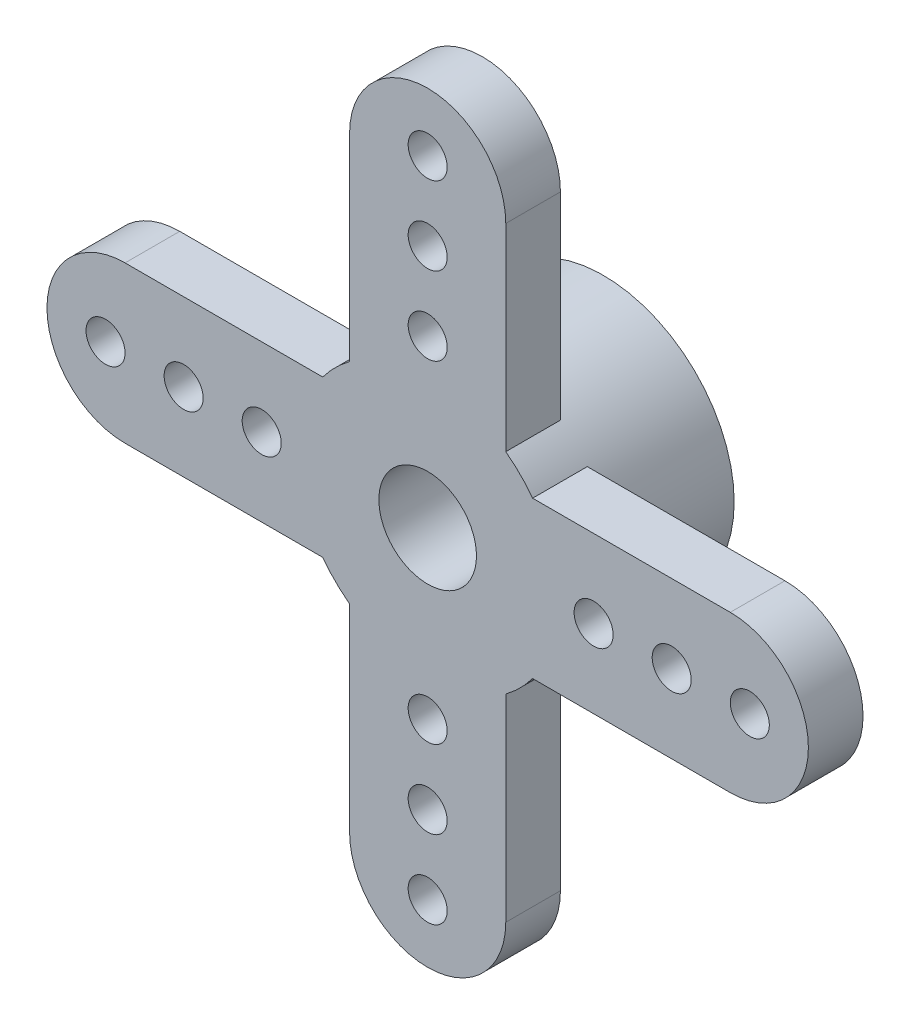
ISO-10303-21;
HEADER;
FILE_DESCRIPTION(('STEP AP214'),'2;1');
FILE_NAME('part.step','',(''),(''),'','','');
FILE_SCHEMA(('AUTOMOTIVE_DESIGN { 1 0 10303 214 1 1 1 1 }'));
ENDSEC;
DATA;
#1=APPLICATION_CONTEXT('core data for automotive mechanical design processes');
#2=APPLICATION_PROTOCOL_DEFINITION('international standard','automotive_design',2000,#1);
#3=PRODUCT_CONTEXT('',#1,'mechanical');
#4=PRODUCT('Part','Part','',(#3));
#5=PRODUCT_RELATED_PRODUCT_CATEGORY('part','',(#4));
#6=PRODUCT_DEFINITION_FORMATION('','',#4);
#7=PRODUCT_DEFINITION_CONTEXT('part definition',#1,'design');
#8=PRODUCT_DEFINITION('design','',#6,#7);
#9=PRODUCT_DEFINITION_SHAPE('','',#8);
#10=(LENGTH_UNIT() NAMED_UNIT(*) SI_UNIT(.MILLI.,.METRE.));
#11=(NAMED_UNIT(*) PLANE_ANGLE_UNIT() SI_UNIT($,.RADIAN.));
#12=(NAMED_UNIT(*) SI_UNIT($,.STERADIAN.) SOLID_ANGLE_UNIT());
#13=UNCERTAINTY_MEASURE_WITH_UNIT(LENGTH_MEASURE(1.E-05),#10,'distance_accuracy_value','');
#14=(GEOMETRIC_REPRESENTATION_CONTEXT(3) GLOBAL_UNCERTAINTY_ASSIGNED_CONTEXT((#13)) GLOBAL_UNIT_ASSIGNED_CONTEXT((#10,
#11,#12)) REPRESENTATION_CONTEXT('',''));
#15=CARTESIAN_POINT('',(0.,0.,0.));
#16=DIRECTION('',(0.,0.,1.));
#17=DIRECTION('',(1.,0.,0.));
#18=AXIS2_PLACEMENT_3D('',#15,#16,#17);
#19=CARTESIAN_POINT('',(0.,0.,4.5));
#20=DIRECTION('',(0.,0.,-1.));
#21=DIRECTION('',(-1.,0.,0.));
#22=AXIS2_PLACEMENT_3D('',#19,#20,#21);
#23=CYLINDRICAL_SURFACE('',#22,3.35);
#24=CARTESIAN_POINT('',(0.,0.,0.));
#25=DIRECTION('',(0.,0.,1.));
#26=DIRECTION('',(1.,0.,0.));
#27=AXIS2_PLACEMENT_3D('',#24,#25,#26);
#28=CIRCLE('',#27,3.35);
#29=CARTESIAN_POINT('',(3.35,0.,0.));
#30=VERTEX_POINT('',#29);
#31=EDGE_CURVE('E380',#30,#30,#28,.T.);
#32=ORIENTED_EDGE('',*,*,#31,.T.);
#33=EDGE_LOOP('',(#32));
#34=FACE_BOUND('',#33,.T.);
#35=DIRECTION('',(0.,0.,-1.));
#36=VECTOR('',#35,1.);
#37=CARTESIAN_POINT('',(-2.,2.68747093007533,4.5));
#38=LINE('',#37,#36);
#39=CARTESIAN_POINT('',(-2.,2.68747093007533,3.1));
#40=VERTEX_POINT('',#39);
#41=CARTESIAN_POINT('',(-2.,2.68747093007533,4.5));
#42=VERTEX_POINT('',#41);
#43=EDGE_CURVE('E11',#40,#42,#38,.F.);
#44=ORIENTED_EDGE('',*,*,#43,.F.);
#45=CARTESIAN_POINT('',(0.,0.,3.1));
#46=DIRECTION('',(0.,0.,1.));
#47=DIRECTION('',(1.,0.,0.));
#48=AXIS2_PLACEMENT_3D('',#45,#46,#47);
#49=CIRCLE('',#48,3.35);
#50=CARTESIAN_POINT('',(2.,2.68747093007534,3.1));
#51=VERTEX_POINT('',#50);
#52=EDGE_CURVE('E366',#51,#40,#49,.T.);
#53=ORIENTED_EDGE('',*,*,#52,.F.);
#54=DIRECTION('',(0.,0.,-1.));
#55=VECTOR('',#54,1.);
#56=CARTESIAN_POINT('',(2.,2.68747093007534,4.5));
#57=LINE('',#56,#55);
#58=CARTESIAN_POINT('',(2.,2.68747093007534,4.5));
#59=VERTEX_POINT('',#58);
#60=EDGE_CURVE('E47',#51,#59,#57,.F.);
#61=ORIENTED_EDGE('',*,*,#60,.T.);
#62=CARTESIAN_POINT('',(0.,0.,4.5));
#63=DIRECTION('',(0.,0.,1.));
#64=DIRECTION('',(1.,0.,0.));
#65=AXIS2_PLACEMENT_3D('',#62,#63,#64);
#66=CIRCLE('',#65,3.35);
#67=CARTESIAN_POINT('',(2.68747093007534,2.,4.5));
#68=VERTEX_POINT('',#67);
#69=EDGE_CURVE('E381',#68,#59,#66,.T.);
#70=ORIENTED_EDGE('',*,*,#69,.F.);
#71=DIRECTION('',(0.,0.,-1.));
#72=VECTOR('',#71,1.);
#73=CARTESIAN_POINT('',(2.68747093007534,2.,4.5));
#74=LINE('',#73,#72);
#75=CARTESIAN_POINT('',(2.68747093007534,2.,3.1));
#76=VERTEX_POINT('',#75);
#77=EDGE_CURVE('E397',#76,#68,#74,.F.);
#78=ORIENTED_EDGE('',*,*,#77,.F.);
#79=CARTESIAN_POINT('',(2.68747093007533,-2.,3.1));
#80=VERTEX_POINT('',#79);
#81=EDGE_CURVE('E342',#80,#76,#49,.T.);
#82=ORIENTED_EDGE('',*,*,#81,.F.);
#83=DIRECTION('',(0.,0.,-1.));
#84=VECTOR('',#83,1.);
#85=CARTESIAN_POINT('',(2.68747093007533,-2.,4.5));
#86=LINE('',#85,#84);
#87=CARTESIAN_POINT('',(2.68747093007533,-2.,4.5));
#88=VERTEX_POINT('',#87);
#89=EDGE_CURVE('E385',#80,#88,#86,.F.);
#90=ORIENTED_EDGE('',*,*,#89,.T.);
#91=CARTESIAN_POINT('',(2.,-2.68747093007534,4.5));
#92=VERTEX_POINT('',#91);
#93=EDGE_CURVE('E387',#92,#88,#66,.T.);
#94=ORIENTED_EDGE('',*,*,#93,.F.);
#95=DIRECTION('',(0.,0.,-1.));
#96=VECTOR('',#95,1.);
#97=CARTESIAN_POINT('',(2.,-2.68747093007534,4.5));
#98=LINE('',#97,#96);
#99=CARTESIAN_POINT('',(2.,-2.68747093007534,3.1));
#100=VERTEX_POINT('',#99);
#101=EDGE_CURVE('E404',#92,#100,#98,.T.);
#102=ORIENTED_EDGE('',*,*,#101,.T.);
#103=CARTESIAN_POINT('',(-2.,-2.68747093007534,3.1));
#104=VERTEX_POINT('',#103);
#105=EDGE_CURVE('E365',#104,#100,#49,.T.);
#106=ORIENTED_EDGE('',*,*,#105,.F.);
#107=DIRECTION('',(0.,0.,-1.));
#108=VECTOR('',#107,1.);
#109=CARTESIAN_POINT('',(-2.,-2.68747093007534,4.5));
#110=LINE('',#109,#108);
#111=CARTESIAN_POINT('',(-2.,-2.68747093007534,4.5));
#112=VERTEX_POINT('',#111);
#113=EDGE_CURVE('E401',#112,#104,#110,.T.);
#114=ORIENTED_EDGE('',*,*,#113,.F.);
#115=CARTESIAN_POINT('',(-2.68747093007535,-1.99999999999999,4.5));
#116=VERTEX_POINT('',#115);
#117=EDGE_CURVE('E938',#116,#112,#66,.T.);
#118=ORIENTED_EDGE('',*,*,#117,.F.);
#119=DIRECTION('',(0.,0.,-1.));
#120=VECTOR('',#119,1.);
#121=CARTESIAN_POINT('',(-2.68747093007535,-1.99999999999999,4.5));
#122=LINE('',#121,#120);
#123=CARTESIAN_POINT('',(-2.68747093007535,-1.99999999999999,3.1));
#124=VERTEX_POINT('',#123);
#125=EDGE_CURVE('E408',#116,#124,#122,.T.);
#126=ORIENTED_EDGE('',*,*,#125,.T.);
#127=CARTESIAN_POINT('',(-2.68747093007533,2.00000000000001,3.1));
#128=VERTEX_POINT('',#127);
#129=EDGE_CURVE('E950',#128,#124,#49,.T.);
#130=ORIENTED_EDGE('',*,*,#129,.F.);
#131=DIRECTION('',(0.,0.,-1.));
#132=VECTOR('',#131,1.);
#133=CARTESIAN_POINT('',(-2.68747093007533,2.00000000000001,4.5));
#134=LINE('',#133,#132);
#135=CARTESIAN_POINT('',(-2.68747093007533,2.00000000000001,4.5));
#136=VERTEX_POINT('',#135);
#137=EDGE_CURVE('E171',#136,#128,#134,.T.);
#138=ORIENTED_EDGE('',*,*,#137,.F.);
#139=EDGE_CURVE('E386',#42,#136,#66,.T.);
#140=ORIENTED_EDGE('',*,*,#139,.F.);
#141=EDGE_LOOP('',(#44,#53,#61,#70,#78,#82,#90,#94,#102,#106,#114,#118,#126,#130,#138,#140));
#142=FACE_BOUND('',#141,.T.);
#143=ADVANCED_FACE('F39',(#34,#142),#23,.T.);
#144=CARTESIAN_POINT('',(0.,0.,4.5));
#145=DIRECTION('',(0.,0.,-1.));
#146=DIRECTION('',(-1.,0.,0.));
#147=AXIS2_PLACEMENT_3D('',#144,#145,#146);
#148=CYLINDRICAL_SURFACE('',#147,2.5);
#149=CARTESIAN_POINT('',(0.,0.,0.));
#150=DIRECTION('',(0.,0.,1.));
#151=DIRECTION('',(1.,0.,0.));
#152=AXIS2_PLACEMENT_3D('',#149,#150,#151);
#153=CIRCLE('',#152,2.5);
#154=CARTESIAN_POINT('',(2.5,0.,0.));
#155=VERTEX_POINT('',#154);
#156=EDGE_CURVE('E376',#155,#155,#153,.T.);
#157=ORIENTED_EDGE('',*,*,#156,.F.);
#158=EDGE_LOOP('',(#157));
#159=FACE_BOUND('',#158,.T.);
#160=CARTESIAN_POINT('',(0.,0.,2.5));
#161=DIRECTION('',(0.,0.,1.));
#162=DIRECTION('',(1.,0.,0.));
#163=AXIS2_PLACEMENT_3D('',#160,#161,#162);
#164=CIRCLE('',#163,2.5);
#165=CARTESIAN_POINT('',(2.5,0.,2.5));
#166=VERTEX_POINT('',#165);
#167=EDGE_CURVE('E375',#166,#166,#164,.T.);
#168=ORIENTED_EDGE('',*,*,#167,.T.);
#169=EDGE_LOOP('',(#168));
#170=FACE_BOUND('',#169,.T.);
#171=ADVANCED_FACE('F457',(#159,#170),#148,.F.);
#172=CARTESIAN_POINT('',(0.,0.,4.5));
#173=DIRECTION('',(0.,0.,1.));
#174=DIRECTION('',(1.,0.,0.));
#175=AXIS2_PLACEMENT_3D('',#172,#173,#174);
#176=PLANE('',#175);
#177=ORIENTED_EDGE('',*,*,#69,.T.);
#178=DIRECTION('',(0.,1.,0.));
#179=VECTOR('',#178,1.);
#180=CARTESIAN_POINT('',(2.,0.,4.5));
#181=LINE('',#180,#179);
#182=CARTESIAN_POINT('',(1.99999999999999,7.75,4.5));
#183=VERTEX_POINT('',#182);
#184=EDGE_CURVE('E291',#59,#183,#181,.T.);
#185=ORIENTED_EDGE('',*,*,#184,.T.);
#186=CARTESIAN_POINT('',(0.,7.75,4.5));
#187=DIRECTION('',(0.,0.,1.));
#188=DIRECTION('',(1.,0.,0.));
#189=AXIS2_PLACEMENT_3D('',#186,#187,#188);
#190=CIRCLE('',#189,2.);
#191=CARTESIAN_POINT('',(-2.00000000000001,7.75,4.5));
#192=VERTEX_POINT('',#191);
#193=EDGE_CURVE('E294',#183,#192,#190,.T.);
#194=ORIENTED_EDGE('',*,*,#193,.T.);
#195=DIRECTION('',(0.,1.,0.));
#196=VECTOR('',#195,1.);
#197=CARTESIAN_POINT('',(-2.,0.,4.5));
#198=LINE('',#197,#196);
#199=EDGE_CURVE('E298',#42,#192,#198,.T.);
#200=ORIENTED_EDGE('',*,*,#199,.F.);
#201=ORIENTED_EDGE('',*,*,#139,.T.);
#202=DIRECTION('',(1.,0.,0.));
#203=VECTOR('',#202,1.);
#204=CARTESIAN_POINT('',(0.,2.,4.5));
#205=LINE('',#204,#203);
#206=CARTESIAN_POINT('',(-7.75,2.00000000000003,4.5));
#207=VERTEX_POINT('',#206);
#208=EDGE_CURVE('E266',#207,#136,#205,.T.);
#209=ORIENTED_EDGE('',*,*,#208,.F.);
#210=CARTESIAN_POINT('',(-7.75,0.,4.5));
#211=DIRECTION('',(0.,0.,1.));
#212=DIRECTION('',(1.,0.,0.));
#213=AXIS2_PLACEMENT_3D('',#210,#211,#212);
#214=CIRCLE('',#213,2.);
#215=CARTESIAN_POINT('',(-7.75000000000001,-1.99999999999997,4.5));
#216=VERTEX_POINT('',#215);
#217=EDGE_CURVE('E160',#207,#216,#214,.T.);
#218=ORIENTED_EDGE('',*,*,#217,.T.);
#219=DIRECTION('',(1.,0.,0.));
#220=VECTOR('',#219,1.);
#221=CARTESIAN_POINT('',(0.,-2.,4.5));
#222=LINE('',#221,#220);
#223=EDGE_CURVE('E61',#216,#116,#222,.T.);
#224=ORIENTED_EDGE('',*,*,#223,.T.);
#225=ORIENTED_EDGE('',*,*,#117,.T.);
#226=DIRECTION('',(0.,1.,0.));
#227=VECTOR('',#226,1.);
#228=CARTESIAN_POINT('',(-2.,0.,4.5));
#229=LINE('',#228,#227);
#230=CARTESIAN_POINT('',(-2.,-7.75,4.5));
#231=VERTEX_POINT('',#230);
#232=EDGE_CURVE('E273',#231,#112,#229,.T.);
#233=ORIENTED_EDGE('',*,*,#232,.F.);
#234=CARTESIAN_POINT('',(0.,-7.75,4.5));
#235=DIRECTION('',(0.,0.,1.));
#236=DIRECTION('',(1.,0.,0.));
#237=AXIS2_PLACEMENT_3D('',#234,#235,#236);
#238=CIRCLE('',#237,2.);
#239=CARTESIAN_POINT('',(2.,-7.75,4.5));
#240=VERTEX_POINT('',#239);
#241=EDGE_CURVE('E276',#231,#240,#238,.T.);
#242=ORIENTED_EDGE('',*,*,#241,.T.);
#243=DIRECTION('',(0.,1.,0.));
#244=VECTOR('',#243,1.);
#245=CARTESIAN_POINT('',(2.,0.,4.5));
#246=LINE('',#245,#244);
#247=EDGE_CURVE('E54',#240,#92,#246,.T.);
#248=ORIENTED_EDGE('',*,*,#247,.T.);
#249=ORIENTED_EDGE('',*,*,#93,.T.);
#250=DIRECTION('',(1.,0.,0.));
#251=VECTOR('',#250,1.);
#252=CARTESIAN_POINT('',(0.,-2.,4.5));
#253=LINE('',#252,#251);
#254=CARTESIAN_POINT('',(7.75,-2.00000000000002,4.5));
#255=VERTEX_POINT('',#254);
#256=EDGE_CURVE('E281',#88,#255,#253,.T.);
#257=ORIENTED_EDGE('',*,*,#256,.T.);
#258=CARTESIAN_POINT('',(7.75,0.,4.5));
#259=DIRECTION('',(0.,0.,1.));
#260=DIRECTION('',(1.,0.,0.));
#261=AXIS2_PLACEMENT_3D('',#258,#259,#260);
#262=CIRCLE('',#261,2.);
#263=CARTESIAN_POINT('',(7.75000000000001,1.99999999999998,4.5));
#264=VERTEX_POINT('',#263);
#265=EDGE_CURVE('E284',#255,#264,#262,.T.);
#266=ORIENTED_EDGE('',*,*,#265,.T.);
#267=DIRECTION('',(1.,0.,0.));
#268=VECTOR('',#267,1.);
#269=CARTESIAN_POINT('',(0.,2.,4.5));
#270=LINE('',#269,#268);
#271=EDGE_CURVE('E288',#68,#264,#270,.T.);
#272=ORIENTED_EDGE('',*,*,#271,.F.);
#273=EDGE_LOOP('',(#177,#185,#194,#200,#201,#209,#218,#224,#225,#233,#242,#248,#249,#257,#266,#272));
#274=FACE_BOUND('',#273,.T.);
#275=CARTESIAN_POINT('',(0.,0.,4.5));
#276=DIRECTION('',(0.,0.,1.));
#277=DIRECTION('',(1.,0.,0.));
#278=AXIS2_PLACEMENT_3D('',#275,#276,#277);
#279=CIRCLE('',#278,1.25);
#280=CARTESIAN_POINT('',(1.25,0.,4.5));
#281=VERTEX_POINT('',#280);
#282=EDGE_CURVE('E367',#281,#281,#279,.T.);
#283=ORIENTED_EDGE('',*,*,#282,.F.);
#284=EDGE_LOOP('',(#283));
#285=FACE_BOUND('',#284,.T.);
#286=CARTESIAN_POINT('',(8.25,0.,4.5));
#287=DIRECTION('',(0.,0.,1.));
#288=DIRECTION('',(1.,0.,0.));
#289=AXIS2_PLACEMENT_3D('',#286,#287,#288);
#290=CIRCLE('',#289,0.5);
#291=CARTESIAN_POINT('',(8.75,0.,4.5));
#292=VERTEX_POINT('',#291);
#293=EDGE_CURVE('E321',#292,#292,#290,.T.);
#294=ORIENTED_EDGE('',*,*,#293,.F.);
#295=EDGE_LOOP('',(#294));
#296=FACE_BOUND('',#295,.T.);
#297=CARTESIAN_POINT('',(6.25,0.,4.5));
#298=DIRECTION('',(0.,0.,1.));
#299=DIRECTION('',(1.,0.,0.));
#300=AXIS2_PLACEMENT_3D('',#297,#298,#299);
#301=CIRCLE('',#300,0.5);
#302=CARTESIAN_POINT('',(6.75,0.,4.5));
#303=VERTEX_POINT('',#302);
#304=EDGE_CURVE('E317',#303,#303,#301,.T.);
#305=ORIENTED_EDGE('',*,*,#304,.F.);
#306=EDGE_LOOP('',(#305));
#307=FACE_BOUND('',#306,.T.);
#308=CARTESIAN_POINT('',(4.25,0.,4.5));
#309=DIRECTION('',(0.,0.,1.));
#310=DIRECTION('',(1.,0.,0.));
#311=AXIS2_PLACEMENT_3D('',#308,#309,#310);
#312=CIRCLE('',#311,0.5);
#313=CARTESIAN_POINT('',(4.75,0.,4.5));
#314=VERTEX_POINT('',#313);
#315=EDGE_CURVE('E313',#314,#314,#312,.T.);
#316=ORIENTED_EDGE('',*,*,#315,.F.);
#317=EDGE_LOOP('',(#316));
#318=FACE_BOUND('',#317,.T.);
#319=CARTESIAN_POINT('',(0.,-8.25,4.5));
#320=DIRECTION('',(0.,0.,1.));
#321=DIRECTION('',(1.,0.,0.));
#322=AXIS2_PLACEMENT_3D('',#319,#320,#321);
#323=CIRCLE('',#322,0.5);
#324=CARTESIAN_POINT('',(0.500000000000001,-8.25,4.5));
#325=VERTEX_POINT('',#324);
#326=EDGE_CURVE('E333',#325,#325,#323,.T.);
#327=ORIENTED_EDGE('',*,*,#326,.F.);
#328=EDGE_LOOP('',(#327));
#329=FACE_BOUND('',#328,.T.);
#330=CARTESIAN_POINT('',(0.,-6.25,4.5));
#331=DIRECTION('',(0.,0.,1.));
#332=DIRECTION('',(1.,0.,0.));
#333=AXIS2_PLACEMENT_3D('',#330,#331,#332);
#334=CIRCLE('',#333,0.5);
#335=CARTESIAN_POINT('',(0.500000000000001,-6.25,4.5));
#336=VERTEX_POINT('',#335);
#337=EDGE_CURVE('E329',#336,#336,#334,.T.);
#338=ORIENTED_EDGE('',*,*,#337,.F.);
#339=EDGE_LOOP('',(#338));
#340=FACE_BOUND('',#339,.T.);
#341=CARTESIAN_POINT('',(0.,-4.25,4.5));
#342=DIRECTION('',(0.,0.,1.));
#343=DIRECTION('',(1.,0.,0.));
#344=AXIS2_PLACEMENT_3D('',#341,#342,#343);
#345=CIRCLE('',#344,0.5);
#346=CARTESIAN_POINT('',(0.500000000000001,-4.25,4.5));
#347=VERTEX_POINT('',#346);
#348=EDGE_CURVE('E325',#347,#347,#345,.T.);
#349=ORIENTED_EDGE('',*,*,#348,.F.);
#350=EDGE_LOOP('',(#349));
#351=FACE_BOUND('',#350,.T.);
#352=CARTESIAN_POINT('',(-4.25,0.,4.5));
#353=DIRECTION('',(0.,0.,1.));
#354=DIRECTION('',(1.,0.,0.));
#355=AXIS2_PLACEMENT_3D('',#352,#353,#354);
#356=CIRCLE('',#355,0.5);
#357=CARTESIAN_POINT('',(-3.75,0.,4.5));
#358=VERTEX_POINT('',#357);
#359=EDGE_CURVE('E262',#358,#358,#356,.T.);
#360=ORIENTED_EDGE('',*,*,#359,.F.);
#361=EDGE_LOOP('',(#360));
#362=FACE_BOUND('',#361,.T.);
#363=CARTESIAN_POINT('',(-6.25,0.,4.5));
#364=DIRECTION('',(0.,0.,1.));
#365=DIRECTION('',(1.,0.,0.));
#366=AXIS2_PLACEMENT_3D('',#363,#364,#365);
#367=CIRCLE('',#366,0.5);
#368=CARTESIAN_POINT('',(-5.75,0.,4.5));
#369=VERTEX_POINT('',#368);
#370=EDGE_CURVE('E258',#369,#369,#367,.T.);
#371=ORIENTED_EDGE('',*,*,#370,.F.);
#372=EDGE_LOOP('',(#371));
#373=FACE_BOUND('',#372,.T.);
#374=CARTESIAN_POINT('',(-8.25,0.,4.5));
#375=DIRECTION('',(0.,0.,1.));
#376=DIRECTION('',(1.,0.,0.));
#377=AXIS2_PLACEMENT_3D('',#374,#375,#376);
#378=CIRCLE('',#377,0.5);
#379=CARTESIAN_POINT('',(-7.75,0.,4.5));
#380=VERTEX_POINT('',#379);
#381=EDGE_CURVE('E254',#380,#380,#378,.T.);
#382=ORIENTED_EDGE('',*,*,#381,.F.);
#383=EDGE_LOOP('',(#382));
#384=FACE_BOUND('',#383,.T.);
#385=CARTESIAN_POINT('',(0.,8.25,4.5));
#386=DIRECTION('',(0.,0.,1.));
#387=DIRECTION('',(1.,0.,0.));
#388=AXIS2_PLACEMENT_3D('',#385,#386,#387);
#389=CIRCLE('',#388,0.5);
#390=CARTESIAN_POINT('',(0.500000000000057,8.25,4.5));
#391=VERTEX_POINT('',#390);
#392=EDGE_CURVE('E309',#391,#391,#389,.T.);
#393=ORIENTED_EDGE('',*,*,#392,.F.);
#394=EDGE_LOOP('',(#393));
#395=FACE_BOUND('',#394,.T.);
#396=CARTESIAN_POINT('',(0.,6.25,4.5));
#397=DIRECTION('',(0.,0.,1.));
#398=DIRECTION('',(1.,0.,0.));
#399=AXIS2_PLACEMENT_3D('',#396,#397,#398);
#400=CIRCLE('',#399,0.5);
#401=CARTESIAN_POINT('',(0.500000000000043,6.25,4.5));
#402=VERTEX_POINT('',#401);
#403=EDGE_CURVE('E305',#402,#402,#400,.T.);
#404=ORIENTED_EDGE('',*,*,#403,.F.);
#405=EDGE_LOOP('',(#404));
#406=FACE_BOUND('',#405,.T.);
#407=CARTESIAN_POINT('',(0.,4.25,4.5));
#408=DIRECTION('',(0.,0.,1.));
#409=DIRECTION('',(1.,0.,0.));
#410=AXIS2_PLACEMENT_3D('',#407,#408,#409);
#411=CIRCLE('',#410,0.5);
#412=CARTESIAN_POINT('',(0.500000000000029,4.25,4.5));
#413=VERTEX_POINT('',#412);
#414=EDGE_CURVE('E301',#413,#413,#411,.T.);
#415=ORIENTED_EDGE('',*,*,#414,.F.);
#416=EDGE_LOOP('',(#415));
#417=FACE_BOUND('',#416,.T.);
#418=ADVANCED_FACE('F422',(#274,#285,#296,#307,#318,#329,#340,#351,#362,#373,#384,#395,#406,
#417),#176,.T.);
#419=CARTESIAN_POINT('',(0.,0.,0.));
#420=DIRECTION('',(0.,0.,1.));
#421=DIRECTION('',(1.,0.,0.));
#422=AXIS2_PLACEMENT_3D('',#419,#420,#421);
#423=PLANE('',#422);
#424=ORIENTED_EDGE('',*,*,#31,.F.);
#425=EDGE_LOOP('',(#424));
#426=FACE_BOUND('',#425,.T.);
#427=ORIENTED_EDGE('',*,*,#156,.T.);
#428=EDGE_LOOP('',(#427));
#429=FACE_BOUND('',#428,.T.);
#430=ADVANCED_FACE('F466',(#426,#429),#423,.F.);
#431=CARTESIAN_POINT('',(0.,0.,2.5));
#432=DIRECTION('',(0.,0.,1.));
#433=DIRECTION('',(1.,0.,0.));
#434=AXIS2_PLACEMENT_3D('',#431,#432,#433);
#435=PLANE('',#434);
#436=CARTESIAN_POINT('',(0.,0.,2.5));
#437=DIRECTION('',(0.,0.,1.));
#438=DIRECTION('',(1.,0.,0.));
#439=AXIS2_PLACEMENT_3D('',#436,#437,#438);
#440=CIRCLE('',#439,1.25);
#441=CARTESIAN_POINT('',(1.25,0.,2.5));
#442=VERTEX_POINT('',#441);
#443=EDGE_CURVE('E371',#442,#442,#440,.F.);
#444=ORIENTED_EDGE('',*,*,#443,.F.);
#445=EDGE_LOOP('',(#444));
#446=FACE_BOUND('',#445,.T.);
#447=ORIENTED_EDGE('',*,*,#167,.F.);
#448=EDGE_LOOP('',(#447));
#449=FACE_BOUND('',#448,.T.);
#450=ADVANCED_FACE('F451',(#446,#449),#435,.F.);
#451=CARTESIAN_POINT('',(0.,0.,-0.00100000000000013));
#452=DIRECTION('',(0.,0.,1.));
#453=DIRECTION('',(1.,0.,0.));
#454=AXIS2_PLACEMENT_3D('',#451,#452,#453);
#455=CYLINDRICAL_SURFACE('',#454,1.25);
#456=ORIENTED_EDGE('',*,*,#282,.T.);
#457=EDGE_LOOP('',(#456));
#458=FACE_BOUND('',#457,.T.);
#459=ORIENTED_EDGE('',*,*,#443,.T.);
#460=EDGE_LOOP('',(#459));
#461=FACE_BOUND('',#460,.T.);
#462=ADVANCED_FACE('F442',(#458,#461),#455,.F.);
#463=CARTESIAN_POINT('',(7.75,0.,3.1));
#464=DIRECTION('',(0.,0.,1.));
#465=DIRECTION('',(1.,0.,0.));
#466=AXIS2_PLACEMENT_3D('',#463,#464,#465);
#467=CYLINDRICAL_SURFACE('',#466,2.);
#468=ORIENTED_EDGE('',*,*,#265,.F.);
#469=DIRECTION('',(0.,0.,1.));
#470=VECTOR('',#469,1.);
#471=CARTESIAN_POINT('',(7.75,-2.00000000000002,3.1));
#472=LINE('',#471,#470);
#473=CARTESIAN_POINT('',(7.75,-2.00000000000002,3.1));
#474=VERTEX_POINT('',#473);
#475=EDGE_CURVE('E351',#474,#255,#472,.T.);
#476=ORIENTED_EDGE('',*,*,#475,.F.);
#477=CARTESIAN_POINT('',(7.75,0.,3.1));
#478=DIRECTION('',(0.,0.,1.));
#479=DIRECTION('',(1.,0.,0.));
#480=AXIS2_PLACEMENT_3D('',#477,#478,#479);
#481=CIRCLE('',#480,2.);
#482=CARTESIAN_POINT('',(7.75000000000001,1.99999999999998,3.1));
#483=VERTEX_POINT('',#482);
#484=EDGE_CURVE('E202',#474,#483,#481,.T.);
#485=ORIENTED_EDGE('',*,*,#484,.T.);
#486=DIRECTION('',(0.,0.,1.));
#487=VECTOR('',#486,1.);
#488=CARTESIAN_POINT('',(7.75000000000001,1.99999999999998,3.1));
#489=LINE('',#488,#487);
#490=EDGE_CURVE('E347',#483,#264,#489,.T.);
#491=ORIENTED_EDGE('',*,*,#490,.T.);
#492=EDGE_LOOP('',(#468,#476,#485,#491));
#493=FACE_BOUND('',#492,.T.);
#494=ADVANCED_FACE('F439',(#493),#467,.T.);
#495=CARTESIAN_POINT('',(4.25,0.,3.1));
#496=DIRECTION('',(0.,0.,1.));
#497=DIRECTION('',(1.,0.,0.));
#498=AXIS2_PLACEMENT_3D('',#495,#496,#497);
#499=CYLINDRICAL_SURFACE('',#498,0.5);
#500=CARTESIAN_POINT('',(4.25,0.,3.1));
#501=DIRECTION('',(0.,0.,1.));
#502=DIRECTION('',(1.,0.,0.));
#503=AXIS2_PLACEMENT_3D('',#500,#501,#502);
#504=CIRCLE('',#503,0.5);
#505=CARTESIAN_POINT('',(4.75,0.,3.1));
#506=VERTEX_POINT('',#505);
#507=EDGE_CURVE('E231',#506,#506,#504,.T.);
#508=ORIENTED_EDGE('',*,*,#507,.F.);
#509=EDGE_LOOP('',(#508));
#510=FACE_BOUND('',#509,.T.);
#511=ORIENTED_EDGE('',*,*,#315,.T.);
#512=EDGE_LOOP('',(#511));
#513=FACE_BOUND('',#512,.T.);
#514=ADVANCED_FACE('F441',(#510,#513),#499,.F.);
#515=CARTESIAN_POINT('',(6.25,0.,3.1));
#516=DIRECTION('',(0.,0.,1.));
#517=DIRECTION('',(1.,0.,0.));
#518=AXIS2_PLACEMENT_3D('',#515,#516,#517);
#519=CYLINDRICAL_SURFACE('',#518,0.5);
#520=CARTESIAN_POINT('',(6.25,0.,3.1));
#521=DIRECTION('',(0.,0.,1.));
#522=DIRECTION('',(1.,0.,0.));
#523=AXIS2_PLACEMENT_3D('',#520,#521,#522);
#524=CIRCLE('',#523,0.5);
#525=CARTESIAN_POINT('',(6.75,0.,3.1));
#526=VERTEX_POINT('',#525);
#527=EDGE_CURVE('E235',#526,#526,#524,.T.);
#528=ORIENTED_EDGE('',*,*,#527,.F.);
#529=EDGE_LOOP('',(#528));
#530=FACE_BOUND('',#529,.T.);
#531=ORIENTED_EDGE('',*,*,#304,.T.);
#532=EDGE_LOOP('',(#531));
#533=FACE_BOUND('',#532,.T.);
#534=ADVANCED_FACE('F448',(#530,#533),#519,.F.);
#535=CARTESIAN_POINT('',(8.25,0.,3.1));
#536=DIRECTION('',(0.,0.,1.));
#537=DIRECTION('',(1.,0.,0.));
#538=AXIS2_PLACEMENT_3D('',#535,#536,#537);
#539=CYLINDRICAL_SURFACE('',#538,0.5);
#540=CARTESIAN_POINT('',(8.25,0.,3.1));
#541=DIRECTION('',(0.,0.,1.));
#542=DIRECTION('',(1.,0.,0.));
#543=AXIS2_PLACEMENT_3D('',#540,#541,#542);
#544=CIRCLE('',#543,0.5);
#545=CARTESIAN_POINT('',(8.75,0.,3.1));
#546=VERTEX_POINT('',#545);
#547=EDGE_CURVE('E239',#546,#546,#544,.T.);
#548=ORIENTED_EDGE('',*,*,#547,.F.);
#549=EDGE_LOOP('',(#548));
#550=FACE_BOUND('',#549,.T.);
#551=ORIENTED_EDGE('',*,*,#293,.T.);
#552=EDGE_LOOP('',(#551));
#553=FACE_BOUND('',#552,.T.);
#554=ADVANCED_FACE('F558',(#550,#553),#539,.F.);
#555=CARTESIAN_POINT('',(0.,0.,3.1));
#556=DIRECTION('',(0.,0.,1.));
#557=DIRECTION('',(1.,0.,0.));
#558=AXIS2_PLACEMENT_3D('',#555,#556,#557);
#559=PLANE('',#558);
#560=ORIENTED_EDGE('',*,*,#547,.T.);
#561=EDGE_LOOP('',(#560));
#562=FACE_BOUND('',#561,.T.);
#563=ORIENTED_EDGE('',*,*,#527,.T.);
#564=EDGE_LOOP('',(#563));
#565=FACE_BOUND('',#564,.T.);
#566=ORIENTED_EDGE('',*,*,#507,.T.);
#567=EDGE_LOOP('',(#566));
#568=FACE_BOUND('',#567,.T.);
#569=DIRECTION('',(1.,0.,0.));
#570=VECTOR('',#569,1.);
#571=CARTESIAN_POINT('',(0.,-2.,3.1));
#572=LINE('',#571,#570);
#573=EDGE_CURVE('E199',#80,#474,#572,.T.);
#574=ORIENTED_EDGE('',*,*,#573,.F.);
#575=ORIENTED_EDGE('',*,*,#81,.T.);
#576=DIRECTION('',(1.,0.,0.));
#577=VECTOR('',#576,1.);
#578=CARTESIAN_POINT('',(0.,2.,3.1));
#579=LINE('',#578,#577);
#580=EDGE_CURVE('E206',#76,#483,#579,.T.);
#581=ORIENTED_EDGE('',*,*,#580,.T.);
#582=ORIENTED_EDGE('',*,*,#484,.F.);
#583=EDGE_LOOP('',(#574,#575,#581,#582));
#584=FACE_BOUND('',#583,.T.);
#585=ADVANCED_FACE('F433',(#562,#565,#568,#584),#559,.F.);
#586=CARTESIAN_POINT('',(0.,-2.,3.1));
#587=DIRECTION('',(0.,-1.,0.));
#588=DIRECTION('',(1.,0.,0.));
#589=AXIS2_PLACEMENT_3D('',#586,#587,#588);
#590=PLANE('',#589);
#591=ORIENTED_EDGE('',*,*,#89,.F.);
#592=ORIENTED_EDGE('',*,*,#573,.T.);
#593=ORIENTED_EDGE('',*,*,#475,.T.);
#594=ORIENTED_EDGE('',*,*,#256,.F.);
#595=EDGE_LOOP('',(#591,#592,#593,#594));
#596=FACE_BOUND('',#595,.T.);
#597=ADVANCED_FACE('F437',(#596),#590,.T.);
#598=CARTESIAN_POINT('',(0.,2.,3.1));
#599=DIRECTION('',(0.,-1.,0.));
#600=DIRECTION('',(1.,0.,0.));
#601=AXIS2_PLACEMENT_3D('',#598,#599,#600);
#602=PLANE('',#601);
#603=ORIENTED_EDGE('',*,*,#580,.F.);
#604=ORIENTED_EDGE('',*,*,#77,.T.);
#605=ORIENTED_EDGE('',*,*,#271,.T.);
#606=ORIENTED_EDGE('',*,*,#490,.F.);
#607=EDGE_LOOP('',(#603,#604,#605,#606));
#608=FACE_BOUND('',#607,.T.);
#609=ADVANCED_FACE('F428',(#608),#602,.F.);
#610=CARTESIAN_POINT('',(0.,-7.75,3.1));
#611=DIRECTION('',(0.,0.,1.));
#612=DIRECTION('',(1.,0.,0.));
#613=AXIS2_PLACEMENT_3D('',#610,#611,#612);
#614=CYLINDRICAL_SURFACE('',#613,2.);
#615=ORIENTED_EDGE('',*,*,#241,.F.);
#616=DIRECTION('',(0.,0.,1.));
#617=VECTOR('',#616,1.);
#618=CARTESIAN_POINT('',(-2.,-7.75,3.1));
#619=LINE('',#618,#617);
#620=CARTESIAN_POINT('',(-2.,-7.75,3.1));
#621=VERTEX_POINT('',#620);
#622=EDGE_CURVE('E358',#621,#231,#619,.T.);
#623=ORIENTED_EDGE('',*,*,#622,.F.);
#624=CARTESIAN_POINT('',(0.,-7.75,3.1));
#625=DIRECTION('',(0.,0.,1.));
#626=DIRECTION('',(1.,0.,0.));
#627=AXIS2_PLACEMENT_3D('',#624,#625,#626);
#628=CIRCLE('',#627,2.);
#629=CARTESIAN_POINT('',(2.,-7.75,3.1));
#630=VERTEX_POINT('',#629);
#631=EDGE_CURVE('E191',#621,#630,#628,.T.);
#632=ORIENTED_EDGE('',*,*,#631,.T.);
#633=DIRECTION('',(0.,0.,1.));
#634=VECTOR('',#633,1.);
#635=CARTESIAN_POINT('',(2.,-7.75,3.1));
#636=LINE('',#635,#634);
#637=EDGE_CURVE('E355',#630,#240,#636,.T.);
#638=ORIENTED_EDGE('',*,*,#637,.T.);
#639=EDGE_LOOP('',(#615,#623,#632,#638));
#640=FACE_BOUND('',#639,.T.);
#641=ADVANCED_FACE('F618',(#640),#614,.T.);
#642=CARTESIAN_POINT('',(0.,-4.25,3.1));
#643=DIRECTION('',(0.,0.,1.));
#644=DIRECTION('',(1.,0.,0.));
#645=AXIS2_PLACEMENT_3D('',#642,#643,#644);
#646=CYLINDRICAL_SURFACE('',#645,0.5);
#647=CARTESIAN_POINT('',(0.,-4.25,3.1));
#648=DIRECTION('',(0.,0.,1.));
#649=DIRECTION('',(1.,0.,0.));
#650=AXIS2_PLACEMENT_3D('',#647,#648,#649);
#651=CIRCLE('',#650,0.5);
#652=CARTESIAN_POINT('',(0.500000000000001,-4.25,3.1));
#653=VERTEX_POINT('',#652);
#654=EDGE_CURVE('E243',#653,#653,#651,.T.);
#655=ORIENTED_EDGE('',*,*,#654,.F.);
#656=EDGE_LOOP('',(#655));
#657=FACE_BOUND('',#656,.T.);
#658=ORIENTED_EDGE('',*,*,#348,.T.);
#659=EDGE_LOOP('',(#658));
#660=FACE_BOUND('',#659,.T.);
#661=ADVANCED_FACE('F628',(#657,#660),#646,.F.);
#662=CARTESIAN_POINT('',(0.,-6.25,3.1));
#663=DIRECTION('',(0.,0.,1.));
#664=DIRECTION('',(1.,0.,0.));
#665=AXIS2_PLACEMENT_3D('',#662,#663,#664);
#666=CYLINDRICAL_SURFACE('',#665,0.5);
#667=CARTESIAN_POINT('',(0.,-6.25,3.1));
#668=DIRECTION('',(0.,0.,1.));
#669=DIRECTION('',(1.,0.,0.));
#670=AXIS2_PLACEMENT_3D('',#667,#668,#669);
#671=CIRCLE('',#670,0.5);
#672=CARTESIAN_POINT('',(0.500000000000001,-6.25,3.1));
#673=VERTEX_POINT('',#672);
#674=EDGE_CURVE('E247',#673,#673,#671,.T.);
#675=ORIENTED_EDGE('',*,*,#674,.F.);
#676=EDGE_LOOP('',(#675));
#677=FACE_BOUND('',#676,.T.);
#678=ORIENTED_EDGE('',*,*,#337,.T.);
#679=EDGE_LOOP('',(#678));
#680=FACE_BOUND('',#679,.T.);
#681=ADVANCED_FACE('F640',(#677,#680),#666,.F.);
#682=CARTESIAN_POINT('',(0.,-8.25,3.1));
#683=DIRECTION('',(0.,0.,1.));
#684=DIRECTION('',(1.,0.,0.));
#685=AXIS2_PLACEMENT_3D('',#682,#683,#684);
#686=CYLINDRICAL_SURFACE('',#685,0.5);
#687=CARTESIAN_POINT('',(0.,-8.25,3.1));
#688=DIRECTION('',(0.,0.,1.));
#689=DIRECTION('',(1.,0.,0.));
#690=AXIS2_PLACEMENT_3D('',#687,#688,#689);
#691=CIRCLE('',#690,0.5);
#692=CARTESIAN_POINT('',(0.500000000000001,-8.25,3.1));
#693=VERTEX_POINT('',#692);
#694=EDGE_CURVE('E165',#693,#693,#691,.T.);
#695=ORIENTED_EDGE('',*,*,#694,.F.);
#696=EDGE_LOOP('',(#695));
#697=FACE_BOUND('',#696,.T.);
#698=ORIENTED_EDGE('',*,*,#326,.T.);
#699=EDGE_LOOP('',(#698));
#700=FACE_BOUND('',#699,.T.);
#701=ADVANCED_FACE('F649',(#697,#700),#686,.F.);
#702=ORIENTED_EDGE('',*,*,#694,.T.);
#703=EDGE_LOOP('',(#702));
#704=FACE_BOUND('',#703,.T.);
#705=ORIENTED_EDGE('',*,*,#674,.T.);
#706=EDGE_LOOP('',(#705));
#707=FACE_BOUND('',#706,.T.);
#708=ORIENTED_EDGE('',*,*,#654,.T.);
#709=EDGE_LOOP('',(#708));
#710=FACE_BOUND('',#709,.T.);
#711=DIRECTION('',(0.,1.,0.));
#712=VECTOR('',#711,1.);
#713=CARTESIAN_POINT('',(-2.,0.,3.1));
#714=LINE('',#713,#712);
#715=EDGE_CURVE('E184',#621,#104,#714,.T.);
#716=ORIENTED_EDGE('',*,*,#715,.T.);
#717=ORIENTED_EDGE('',*,*,#105,.T.);
#718=DIRECTION('',(0.,1.,0.));
#719=VECTOR('',#718,1.);
#720=CARTESIAN_POINT('',(2.,0.,3.1));
#721=LINE('',#720,#719);
#722=EDGE_CURVE('E195',#630,#100,#721,.T.);
#723=ORIENTED_EDGE('',*,*,#722,.F.);
#724=ORIENTED_EDGE('',*,*,#631,.F.);
#725=EDGE_LOOP('',(#716,#717,#723,#724));
#726=FACE_BOUND('',#725,.T.);
#727=ADVANCED_FACE('F578',(#704,#707,#710,#726),#559,.F.);
#728=CARTESIAN_POINT('',(-2.,0.,3.1));
#729=DIRECTION('',(1.,0.,0.));
#730=DIRECTION('',(0.,1.,0.));
#731=AXIS2_PLACEMENT_3D('',#728,#729,#730);
#732=PLANE('',#731);
#733=ORIENTED_EDGE('',*,*,#232,.T.);
#734=ORIENTED_EDGE('',*,*,#113,.T.);
#735=ORIENTED_EDGE('',*,*,#715,.F.);
#736=ORIENTED_EDGE('',*,*,#622,.T.);
#737=EDGE_LOOP('',(#733,#734,#735,#736));
#738=FACE_BOUND('',#737,.T.);
#739=ADVANCED_FACE('F666',(#738),#732,.F.);
#740=CARTESIAN_POINT('',(2.,0.,3.1));
#741=DIRECTION('',(1.,0.,0.));
#742=DIRECTION('',(0.,1.,0.));
#743=AXIS2_PLACEMENT_3D('',#740,#741,#742);
#744=PLANE('',#743);
#745=ORIENTED_EDGE('',*,*,#101,.F.);
#746=ORIENTED_EDGE('',*,*,#247,.F.);
#747=ORIENTED_EDGE('',*,*,#637,.F.);
#748=ORIENTED_EDGE('',*,*,#722,.T.);
#749=EDGE_LOOP('',(#745,#746,#747,#748));
#750=FACE_BOUND('',#749,.T.);
#751=ADVANCED_FACE('F698',(#750),#744,.T.);
#752=CARTESIAN_POINT('',(-7.75,0.,3.1));
#753=DIRECTION('',(0.,0.,1.));
#754=DIRECTION('',(1.,0.,0.));
#755=AXIS2_PLACEMENT_3D('',#752,#753,#754);
#756=CYLINDRICAL_SURFACE('',#755,2.);
#757=ORIENTED_EDGE('',*,*,#217,.F.);
#758=DIRECTION('',(0.,0.,1.));
#759=VECTOR('',#758,1.);
#760=CARTESIAN_POINT('',(-7.75,2.00000000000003,3.1));
#761=LINE('',#760,#759);
#762=CARTESIAN_POINT('',(-7.75,2.00000000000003,3.1));
#763=VERTEX_POINT('',#762);
#764=EDGE_CURVE('E155',#763,#207,#761,.T.);
#765=ORIENTED_EDGE('',*,*,#764,.F.);
#766=CARTESIAN_POINT('',(-7.75,0.,3.1));
#767=DIRECTION('',(0.,0.,1.));
#768=DIRECTION('',(1.,0.,0.));
#769=AXIS2_PLACEMENT_3D('',#766,#767,#768);
#770=CIRCLE('',#769,2.);
#771=CARTESIAN_POINT('',(-7.75000000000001,-1.99999999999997,3.1));
#772=VERTEX_POINT('',#771);
#773=EDGE_CURVE('E159',#763,#772,#770,.T.);
#774=ORIENTED_EDGE('',*,*,#773,.T.);
#775=DIRECTION('',(0.,0.,1.));
#776=VECTOR('',#775,1.);
#777=CARTESIAN_POINT('',(-7.75000000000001,-1.99999999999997,3.1));
#778=LINE('',#777,#776);
#779=EDGE_CURVE('E164',#772,#216,#778,.T.);
#780=ORIENTED_EDGE('',*,*,#779,.T.);
#781=EDGE_LOOP('',(#757,#765,#774,#780));
#782=FACE_BOUND('',#781,.T.);
#783=ADVANCED_FACE('F157',(#782),#756,.T.);
#784=CARTESIAN_POINT('',(-8.25,0.,3.1));
#785=DIRECTION('',(0.,0.,1.));
#786=DIRECTION('',(1.,0.,0.));
#787=AXIS2_PLACEMENT_3D('',#784,#785,#786);
#788=CYLINDRICAL_SURFACE('',#787,0.5);
#789=CARTESIAN_POINT('',(-8.25,0.,3.1));
#790=DIRECTION('',(0.,0.,1.));
#791=DIRECTION('',(1.,0.,0.));
#792=AXIS2_PLACEMENT_3D('',#789,#790,#791);
#793=CIRCLE('',#792,0.5);
#794=CARTESIAN_POINT('',(-7.75,0.,3.1));
#795=VERTEX_POINT('',#794);
#796=EDGE_CURVE('E337',#795,#795,#793,.T.);
#797=ORIENTED_EDGE('',*,*,#796,.F.);
#798=EDGE_LOOP('',(#797));
#799=FACE_BOUND('',#798,.T.);
#800=ORIENTED_EDGE('',*,*,#381,.T.);
#801=EDGE_LOOP('',(#800));
#802=FACE_BOUND('',#801,.T.);
#803=ADVANCED_FACE('F721',(#799,#802),#788,.F.);
#804=CARTESIAN_POINT('',(-6.25,0.,3.1));
#805=DIRECTION('',(0.,0.,1.));
#806=DIRECTION('',(1.,0.,0.));
#807=AXIS2_PLACEMENT_3D('',#804,#805,#806);
#808=CYLINDRICAL_SURFACE('',#807,0.5);
#809=CARTESIAN_POINT('',(-6.25,0.,3.1));
#810=DIRECTION('',(0.,0.,1.));
#811=DIRECTION('',(1.,0.,0.));
#812=AXIS2_PLACEMENT_3D('',#809,#810,#811);
#813=CIRCLE('',#812,0.5);
#814=CARTESIAN_POINT('',(-5.75,0.,3.1));
#815=VERTEX_POINT('',#814);
#816=EDGE_CURVE('E969',#815,#815,#813,.T.);
#817=ORIENTED_EDGE('',*,*,#816,.F.);
#818=EDGE_LOOP('',(#817));
#819=FACE_BOUND('',#818,.T.);
#820=ORIENTED_EDGE('',*,*,#370,.T.);
#821=EDGE_LOOP('',(#820));
#822=FACE_BOUND('',#821,.T.);
#823=ADVANCED_FACE('F732',(#819,#822),#808,.F.);
#824=CARTESIAN_POINT('',(-4.25,0.,3.1));
#825=DIRECTION('',(0.,0.,1.));
#826=DIRECTION('',(1.,0.,0.));
#827=AXIS2_PLACEMENT_3D('',#824,#825,#826);
#828=CYLINDRICAL_SURFACE('',#827,0.5);
#829=CARTESIAN_POINT('',(-4.25,0.,3.1));
#830=DIRECTION('',(0.,0.,1.));
#831=DIRECTION('',(1.,0.,0.));
#832=AXIS2_PLACEMENT_3D('',#829,#830,#831);
#833=CIRCLE('',#832,0.5);
#834=CARTESIAN_POINT('',(-3.75,0.,3.1));
#835=VERTEX_POINT('',#834);
#836=EDGE_CURVE('E175',#835,#835,#833,.T.);
#837=ORIENTED_EDGE('',*,*,#836,.F.);
#838=EDGE_LOOP('',(#837));
#839=FACE_BOUND('',#838,.T.);
#840=ORIENTED_EDGE('',*,*,#359,.T.);
#841=EDGE_LOOP('',(#840));
#842=FACE_BOUND('',#841,.T.);
#843=ADVANCED_FACE('F740',(#839,#842),#828,.F.);
#844=ORIENTED_EDGE('',*,*,#836,.T.);
#845=EDGE_LOOP('',(#844));
#846=FACE_BOUND('',#845,.T.);
#847=ORIENTED_EDGE('',*,*,#816,.T.);
#848=EDGE_LOOP('',(#847));
#849=FACE_BOUND('',#848,.T.);
#850=ORIENTED_EDGE('',*,*,#796,.T.);
#851=EDGE_LOOP('',(#850));
#852=FACE_BOUND('',#851,.T.);
#853=DIRECTION('',(1.,0.,0.));
#854=VECTOR('',#853,1.);
#855=CARTESIAN_POINT('',(0.,2.,3.1));
#856=LINE('',#855,#854);
#857=EDGE_CURVE('E168',#763,#128,#856,.T.);
#858=ORIENTED_EDGE('',*,*,#857,.T.);
#859=ORIENTED_EDGE('',*,*,#129,.T.);
#860=DIRECTION('',(1.,0.,0.));
#861=VECTOR('',#860,1.);
#862=CARTESIAN_POINT('',(0.,-2.,3.1));
#863=LINE('',#862,#861);
#864=EDGE_CURVE('E180',#772,#124,#863,.T.);
#865=ORIENTED_EDGE('',*,*,#864,.F.);
#866=ORIENTED_EDGE('',*,*,#773,.F.);
#867=EDGE_LOOP('',(#858,#859,#865,#866));
#868=FACE_BOUND('',#867,.T.);
#869=ADVANCED_FACE('F178',(#846,#849,#852,#868),#559,.F.);
#870=CARTESIAN_POINT('',(0.,-2.,3.1));
#871=DIRECTION('',(0.,-1.,0.));
#872=DIRECTION('',(1.,0.,0.));
#873=AXIS2_PLACEMENT_3D('',#870,#871,#872);
#874=PLANE('',#873);
#875=ORIENTED_EDGE('',*,*,#125,.F.);
#876=ORIENTED_EDGE('',*,*,#223,.F.);
#877=ORIENTED_EDGE('',*,*,#779,.F.);
#878=ORIENTED_EDGE('',*,*,#864,.T.);
#879=EDGE_LOOP('',(#875,#876,#877,#878));
#880=FACE_BOUND('',#879,.T.);
#881=ADVANCED_FACE('F757',(#880),#874,.T.);
#882=CARTESIAN_POINT('',(0.,2.,3.1));
#883=DIRECTION('',(0.,-1.,0.));
#884=DIRECTION('',(1.,0.,0.));
#885=AXIS2_PLACEMENT_3D('',#882,#883,#884);
#886=PLANE('',#885);
#887=ORIENTED_EDGE('',*,*,#208,.T.);
#888=ORIENTED_EDGE('',*,*,#137,.T.);
#889=ORIENTED_EDGE('',*,*,#857,.F.);
#890=ORIENTED_EDGE('',*,*,#764,.T.);
#891=EDGE_LOOP('',(#887,#888,#889,#890));
#892=FACE_BOUND('',#891,.T.);
#893=ADVANCED_FACE('F169',(#892),#886,.F.);
#894=CARTESIAN_POINT('',(-2.,0.,3.1));
#895=DIRECTION('',(1.,0.,0.));
#896=DIRECTION('',(0.,1.,0.));
#897=AXIS2_PLACEMENT_3D('',#894,#895,#896);
#898=PLANE('',#897);
#899=DIRECTION('',(0.,1.,0.));
#900=VECTOR('',#899,1.);
#901=CARTESIAN_POINT('',(-2.,0.,3.1));
#902=LINE('',#901,#900);
#903=CARTESIAN_POINT('',(-2.00000000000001,7.75,3.1));
#904=VERTEX_POINT('',#903);
#905=EDGE_CURVE('E216',#40,#904,#902,.T.);
#906=ORIENTED_EDGE('',*,*,#905,.F.);
#907=ORIENTED_EDGE('',*,*,#43,.T.);
#908=ORIENTED_EDGE('',*,*,#199,.T.);
#909=DIRECTION('',(0.,0.,1.));
#910=VECTOR('',#909,1.);
#911=CARTESIAN_POINT('',(-2.00000000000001,7.75,3.1));
#912=LINE('',#911,#910);
#913=EDGE_CURVE('E338',#904,#192,#912,.T.);
#914=ORIENTED_EDGE('',*,*,#913,.F.);
#915=EDGE_LOOP('',(#906,#907,#908,#914));
#916=FACE_BOUND('',#915,.T.);
#917=ADVANCED_FACE('F800',(#916),#898,.F.);
#918=CARTESIAN_POINT('',(2.,0.,3.1));
#919=DIRECTION('',(1.,0.,0.));
#920=DIRECTION('',(0.,1.,0.));
#921=AXIS2_PLACEMENT_3D('',#918,#919,#920);
#922=PLANE('',#921);
#923=ORIENTED_EDGE('',*,*,#60,.F.);
#924=DIRECTION('',(0.,1.,0.));
#925=VECTOR('',#924,1.);
#926=CARTESIAN_POINT('',(2.,0.,3.1));
#927=LINE('',#926,#925);
#928=CARTESIAN_POINT('',(1.99999999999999,7.75,3.1));
#929=VERTEX_POINT('',#928);
#930=EDGE_CURVE('E209',#51,#929,#927,.T.);
#931=ORIENTED_EDGE('',*,*,#930,.T.);
#932=DIRECTION('',(0.,0.,1.));
#933=VECTOR('',#932,1.);
#934=CARTESIAN_POINT('',(1.99999999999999,7.75,3.1));
#935=LINE('',#934,#933);
#936=EDGE_CURVE('E343',#929,#183,#935,.T.);
#937=ORIENTED_EDGE('',*,*,#936,.T.);
#938=ORIENTED_EDGE('',*,*,#184,.F.);
#939=EDGE_LOOP('',(#923,#931,#937,#938));
#940=FACE_BOUND('',#939,.T.);
#941=ADVANCED_FACE('F811',(#940),#922,.T.);
#942=CARTESIAN_POINT('',(0.,8.25,3.1));
#943=DIRECTION('',(0.,0.,1.));
#944=DIRECTION('',(1.,0.,0.));
#945=AXIS2_PLACEMENT_3D('',#942,#943,#944);
#946=CIRCLE('',#945,0.5);
#947=CARTESIAN_POINT('',(0.500000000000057,8.25,3.1));
#948=VERTEX_POINT('',#947);
#949=EDGE_CURVE('E227',#948,#948,#946,.T.);
#950=ORIENTED_EDGE('',*,*,#949,.T.);
#951=EDGE_LOOP('',(#950));
#952=FACE_BOUND('',#951,.T.);
#953=CARTESIAN_POINT('',(0.,6.25,3.1));
#954=DIRECTION('',(0.,0.,1.));
#955=DIRECTION('',(1.,0.,0.));
#956=AXIS2_PLACEMENT_3D('',#953,#954,#955);
#957=CIRCLE('',#956,0.5);
#958=CARTESIAN_POINT('',(0.500000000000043,6.25,3.1));
#959=VERTEX_POINT('',#958);
#960=EDGE_CURVE('E223',#959,#959,#957,.T.);
#961=ORIENTED_EDGE('',*,*,#960,.T.);
#962=EDGE_LOOP('',(#961));
#963=FACE_BOUND('',#962,.T.);
#964=CARTESIAN_POINT('',(0.,4.25,3.1));
#965=DIRECTION('',(0.,0.,1.));
#966=DIRECTION('',(1.,0.,0.));
#967=AXIS2_PLACEMENT_3D('',#964,#965,#966);
#968=CIRCLE('',#967,0.5);
#969=CARTESIAN_POINT('',(0.500000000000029,4.25,3.1));
#970=VERTEX_POINT('',#969);
#971=EDGE_CURVE('E219',#970,#970,#968,.T.);
#972=ORIENTED_EDGE('',*,*,#971,.T.);
#973=EDGE_LOOP('',(#972));
#974=FACE_BOUND('',#973,.T.);
#975=ORIENTED_EDGE('',*,*,#930,.F.);
#976=ORIENTED_EDGE('',*,*,#52,.T.);
#977=ORIENTED_EDGE('',*,*,#905,.T.);
#978=CARTESIAN_POINT('',(0.,7.75,3.1));
#979=DIRECTION('',(0.,0.,1.));
#980=DIRECTION('',(1.,0.,0.));
#981=AXIS2_PLACEMENT_3D('',#978,#979,#980);
#982=CIRCLE('',#981,2.);
#983=EDGE_CURVE('E212',#929,#904,#982,.T.);
#984=ORIENTED_EDGE('',*,*,#983,.F.);
#985=EDGE_LOOP('',(#975,#976,#977,#984));
#986=FACE_BOUND('',#985,.T.);
#987=ADVANCED_FACE('F577',(#952,#963,#974,#986),#559,.F.);
#988=CARTESIAN_POINT('',(0.,7.75,3.1));
#989=DIRECTION('',(0.,0.,1.));
#990=DIRECTION('',(1.,0.,0.));
#991=AXIS2_PLACEMENT_3D('',#988,#989,#990);
#992=CYLINDRICAL_SURFACE('',#991,2.);
#993=ORIENTED_EDGE('',*,*,#193,.F.);
#994=ORIENTED_EDGE('',*,*,#936,.F.);
#995=ORIENTED_EDGE('',*,*,#983,.T.);
#996=ORIENTED_EDGE('',*,*,#913,.T.);
#997=EDGE_LOOP('',(#993,#994,#995,#996));
#998=FACE_BOUND('',#997,.T.);
#999=ADVANCED_FACE('F833',(#998),#992,.T.);
#1000=CARTESIAN_POINT('',(0.,8.25,3.1));
#1001=DIRECTION('',(0.,0.,1.));
#1002=DIRECTION('',(1.,0.,0.));
#1003=AXIS2_PLACEMENT_3D('',#1000,#1001,#1002);
#1004=CYLINDRICAL_SURFACE('',#1003,0.5);
#1005=ORIENTED_EDGE('',*,*,#949,.F.);
#1006=EDGE_LOOP('',(#1005));
#1007=FACE_BOUND('',#1006,.T.);
#1008=ORIENTED_EDGE('',*,*,#392,.T.);
#1009=EDGE_LOOP('',(#1008));
#1010=FACE_BOUND('',#1009,.T.);
#1011=ADVANCED_FACE('F865',(#1007,#1010),#1004,.F.);
#1012=CARTESIAN_POINT('',(0.,6.25,3.1));
#1013=DIRECTION('',(0.,0.,1.));
#1014=DIRECTION('',(1.,0.,0.));
#1015=AXIS2_PLACEMENT_3D('',#1012,#1013,#1014);
#1016=CYLINDRICAL_SURFACE('',#1015,0.5);
#1017=ORIENTED_EDGE('',*,*,#960,.F.);
#1018=EDGE_LOOP('',(#1017));
#1019=FACE_BOUND('',#1018,.T.);
#1020=ORIENTED_EDGE('',*,*,#403,.T.);
#1021=EDGE_LOOP('',(#1020));
#1022=FACE_BOUND('',#1021,.T.);
#1023=ADVANCED_FACE('F877',(#1019,#1022),#1016,.F.);
#1024=CARTESIAN_POINT('',(0.,4.25,3.1));
#1025=DIRECTION('',(0.,0.,1.));
#1026=DIRECTION('',(1.,0.,0.));
#1027=AXIS2_PLACEMENT_3D('',#1024,#1025,#1026);
#1028=CYLINDRICAL_SURFACE('',#1027,0.5);
#1029=ORIENTED_EDGE('',*,*,#971,.F.);
#1030=EDGE_LOOP('',(#1029));
#1031=FACE_BOUND('',#1030,.T.);
#1032=ORIENTED_EDGE('',*,*,#414,.T.);
#1033=EDGE_LOOP('',(#1032));
#1034=FACE_BOUND('',#1033,.T.);
#1035=ADVANCED_FACE('F886',(#1031,#1034),#1028,.F.);
#1036=CLOSED_SHELL('',(#143,#171,#418,#430,#450,#462,#494,#514,#534,#554,#585,#597,#609,#641,
#661,#681,#701,#727,#739,#751,#783,#803,#823,#843,#869,#881,#893,#917,#941,#987,#999,#1011,
#1023,#1035));
#1037=MANIFOLD_SOLID_BREP('B2',#1036);
#1038=ADVANCED_BREP_SHAPE_REPRESENTATION('',(#18,#1037),#14);
#1039=SHAPE_DEFINITION_REPRESENTATION(#9,#1038);
ENDSEC;
END-ISO-10303-21;
